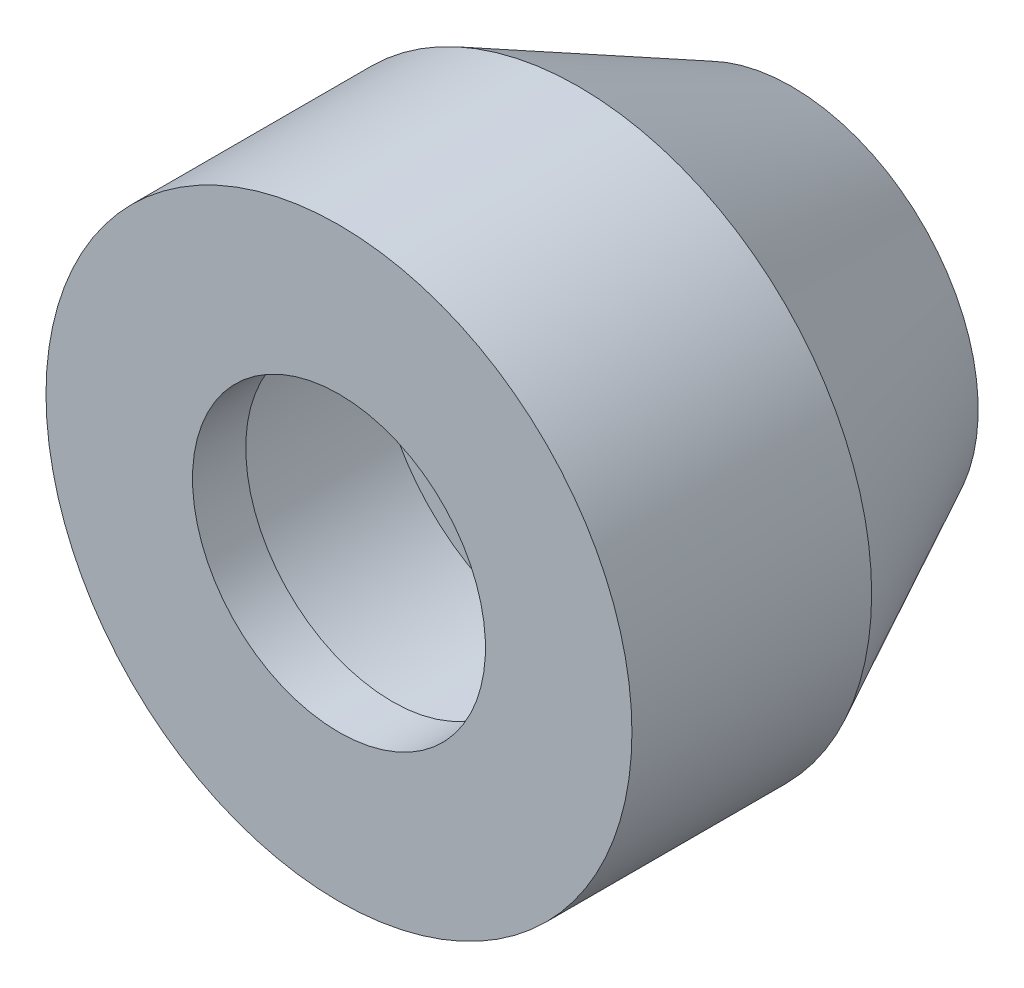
ISO-10303-21;
HEADER;
FILE_DESCRIPTION(('STEP AP214'),'2;1');
FILE_NAME('part.step','',(''),(''),'','','');
FILE_SCHEMA(('AUTOMOTIVE_DESIGN { 1 0 10303 214 1 1 1 1 }'));
ENDSEC;
DATA;
#1=APPLICATION_CONTEXT('core data for automotive mechanical design processes');
#2=APPLICATION_PROTOCOL_DEFINITION('international standard','automotive_design',2000,#1);
#3=PRODUCT_CONTEXT('',#1,'mechanical');
#4=PRODUCT('Part','Part','',(#3));
#5=PRODUCT_RELATED_PRODUCT_CATEGORY('part','',(#4));
#6=PRODUCT_DEFINITION_FORMATION('','',#4);
#7=PRODUCT_DEFINITION_CONTEXT('part definition',#1,'design');
#8=PRODUCT_DEFINITION('design','',#6,#7);
#9=PRODUCT_DEFINITION_SHAPE('','',#8);
#10=(LENGTH_UNIT() NAMED_UNIT(*) SI_UNIT(.MILLI.,.METRE.));
#11=(NAMED_UNIT(*) PLANE_ANGLE_UNIT() SI_UNIT($,.RADIAN.));
#12=(NAMED_UNIT(*) SI_UNIT($,.STERADIAN.) SOLID_ANGLE_UNIT());
#13=UNCERTAINTY_MEASURE_WITH_UNIT(LENGTH_MEASURE(1.E-05),#10,'distance_accuracy_value','');
#14=(GEOMETRIC_REPRESENTATION_CONTEXT(3) GLOBAL_UNCERTAINTY_ASSIGNED_CONTEXT((#13)) GLOBAL_UNIT_ASSIGNED_CONTEXT((#10,
#11,#12)) REPRESENTATION_CONTEXT('',''));
#15=CARTESIAN_POINT('',(0.,0.,0.));
#16=DIRECTION('',(0.,0.,1.));
#17=DIRECTION('',(1.,0.,0.));
#18=AXIS2_PLACEMENT_3D('',#15,#16,#17);
#19=CARTESIAN_POINT('',(0.,0.,4.3));
#20=DIRECTION('',(0.,0.,1.));
#21=DIRECTION('',(0.,-1.,0.));
#22=AXIS2_PLACEMENT_3D('',#19,#20,#21);
#23=PLANE('',#22);
#24=CARTESIAN_POINT('',(0.,0.,4.3));
#25=DIRECTION('',(0.,0.,1.));
#26=DIRECTION('',(0.,-1.,0.));
#27=AXIS2_PLACEMENT_3D('',#24,#25,#26);
#28=CIRCLE('',#27,3.5);
#29=CARTESIAN_POINT('',(0.,-3.5,4.3));
#30=VERTEX_POINT('',#29);
#31=EDGE_CURVE('E8',#30,#30,#28,.T.);
#32=ORIENTED_EDGE('',*,*,#31,.T.);
#33=EDGE_LOOP('',(#32));
#34=FACE_BOUND('',#33,.T.);
#35=ADVANCED_FACE('F12',(#34),#23,.T.);
#36=CARTESIAN_POINT('',(0.,0.,0.));
#37=DIRECTION('',(0.,0.,1.));
#38=DIRECTION('',(0.,-1.,0.));
#39=AXIS2_PLACEMENT_3D('',#36,#37,#38);
#40=CYLINDRICAL_SURFACE('',#39,3.5);
#41=CARTESIAN_POINT('',(0.,0.,7.5));
#42=DIRECTION('',(0.,0.,1.));
#43=DIRECTION('',(0.,-1.,0.));
#44=AXIS2_PLACEMENT_3D('',#41,#42,#43);
#45=CIRCLE('',#44,3.5);
#46=CARTESIAN_POINT('',(0.,-3.5,7.5));
#47=VERTEX_POINT('',#46);
#48=EDGE_CURVE('E18',#47,#47,#45,.T.);
#49=ORIENTED_EDGE('',*,*,#48,.T.);
#50=EDGE_LOOP('',(#49));
#51=FACE_BOUND('',#50,.T.);
#52=ORIENTED_EDGE('',*,*,#31,.F.);
#53=EDGE_LOOP('',(#52));
#54=FACE_BOUND('',#53,.T.);
#55=ADVANCED_FACE('F55',(#51,#54),#40,.F.);
#56=CARTESIAN_POINT('',(3.5,0.,7.5));
#57=DIRECTION('',(0.,0.,-1.));
#58=DIRECTION('',(0.,1.,0.));
#59=AXIS2_PLACEMENT_3D('',#56,#57,#58);
#60=PLANE('',#59);
#61=CARTESIAN_POINT('',(0.,0.,7.5));
#62=DIRECTION('',(0.,0.,1.));
#63=DIRECTION('',(0.,-1.,0.));
#64=AXIS2_PLACEMENT_3D('',#61,#62,#63);
#65=CIRCLE('',#64,2.75);
#66=CARTESIAN_POINT('',(0.,-2.75,7.5));
#67=VERTEX_POINT('',#66);
#68=EDGE_CURVE('E22',#67,#67,#65,.T.);
#69=ORIENTED_EDGE('',*,*,#68,.T.);
#70=EDGE_LOOP('',(#69));
#71=FACE_BOUND('',#70,.T.);
#72=ORIENTED_EDGE('',*,*,#48,.F.);
#73=EDGE_LOOP('',(#72));
#74=FACE_BOUND('',#73,.T.);
#75=ADVANCED_FACE('F60',(#71,#74),#60,.T.);
#76=CARTESIAN_POINT('',(0.,0.,0.));
#77=DIRECTION('',(0.,0.,1.));
#78=DIRECTION('',(0.,-1.,0.));
#79=AXIS2_PLACEMENT_3D('',#76,#77,#78);
#80=CYLINDRICAL_SURFACE('',#79,2.75);
#81=CARTESIAN_POINT('',(0.,0.,8.5));
#82=DIRECTION('',(0.,0.,1.));
#83=DIRECTION('',(0.,-1.,0.));
#84=AXIS2_PLACEMENT_3D('',#81,#82,#83);
#85=CIRCLE('',#84,2.75);
#86=CARTESIAN_POINT('',(0.,-2.75,8.5));
#87=VERTEX_POINT('',#86);
#88=EDGE_CURVE('E26',#87,#87,#85,.T.);
#89=ORIENTED_EDGE('',*,*,#88,.T.);
#90=EDGE_LOOP('',(#89));
#91=FACE_BOUND('',#90,.T.);
#92=ORIENTED_EDGE('',*,*,#68,.F.);
#93=EDGE_LOOP('',(#92));
#94=FACE_BOUND('',#93,.T.);
#95=ADVANCED_FACE('F65',(#91,#94),#80,.F.);
#96=CARTESIAN_POINT('',(2.75,0.,8.5));
#97=DIRECTION('',(0.,0.,1.));
#98=DIRECTION('',(0.,-1.,0.));
#99=AXIS2_PLACEMENT_3D('',#96,#97,#98);
#100=PLANE('',#99);
#101=CARTESIAN_POINT('',(0.,0.,8.5));
#102=DIRECTION('',(0.,0.,1.));
#103=DIRECTION('',(0.,-1.,0.));
#104=AXIS2_PLACEMENT_3D('',#101,#102,#103);
#105=CIRCLE('',#104,5.5);
#106=CARTESIAN_POINT('',(0.,-5.5,8.5));
#107=VERTEX_POINT('',#106);
#108=EDGE_CURVE('E31',#107,#107,#105,.T.);
#109=ORIENTED_EDGE('',*,*,#108,.T.);
#110=EDGE_LOOP('',(#109));
#111=FACE_BOUND('',#110,.T.);
#112=ORIENTED_EDGE('',*,*,#88,.F.);
#113=EDGE_LOOP('',(#112));
#114=FACE_BOUND('',#113,.T.);
#115=ADVANCED_FACE('F72',(#111,#114),#100,.T.);
#116=CARTESIAN_POINT('',(0.,0.,0.));
#117=DIRECTION('',(0.,0.,1.));
#118=DIRECTION('',(0.,-1.,0.));
#119=AXIS2_PLACEMENT_3D('',#116,#117,#118);
#120=CYLINDRICAL_SURFACE('',#119,5.5);
#121=CARTESIAN_POINT('',(0.,0.,4.));
#122=DIRECTION('',(0.,0.,1.));
#123=DIRECTION('',(0.,-1.,0.));
#124=AXIS2_PLACEMENT_3D('',#121,#122,#123);
#125=CIRCLE('',#124,5.5);
#126=CARTESIAN_POINT('',(0.,-5.5,4.));
#127=VERTEX_POINT('',#126);
#128=EDGE_CURVE('E34',#127,#127,#125,.T.);
#129=ORIENTED_EDGE('',*,*,#128,.T.);
#130=EDGE_LOOP('',(#129));
#131=FACE_BOUND('',#130,.T.);
#132=ORIENTED_EDGE('',*,*,#108,.F.);
#133=EDGE_LOOP('',(#132));
#134=FACE_BOUND('',#133,.T.);
#135=ADVANCED_FACE('F52',(#131,#134),#120,.T.);
#136=CARTESIAN_POINT('',(0.,0.,4.));
#137=DIRECTION('',(0.,0.,1.));
#138=DIRECTION('',(0.,-1.,0.));
#139=AXIS2_PLACEMENT_3D('',#136,#137,#138);
#140=CONICAL_SURFACE('',#139,5.5,0.463647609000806);
#141=CARTESIAN_POINT('',(0.,0.,0.));
#142=DIRECTION('',(0.,0.,1.));
#143=DIRECTION('',(0.,-1.,0.));
#144=AXIS2_PLACEMENT_3D('',#141,#142,#143);
#145=CIRCLE('',#144,3.5);
#146=CARTESIAN_POINT('',(0.,-3.5,0.));
#147=VERTEX_POINT('',#146);
#148=EDGE_CURVE('E37',#147,#147,#145,.T.);
#149=ORIENTED_EDGE('',*,*,#148,.T.);
#150=EDGE_LOOP('',(#149));
#151=FACE_BOUND('',#150,.T.);
#152=ORIENTED_EDGE('',*,*,#128,.F.);
#153=EDGE_LOOP('',(#152));
#154=FACE_BOUND('',#153,.T.);
#155=ADVANCED_FACE('F41',(#151,#154),#140,.T.);
#156=CARTESIAN_POINT('',(3.5,0.,0.));
#157=DIRECTION('',(0.,0.,-1.));
#158=DIRECTION('',(0.,1.,0.));
#159=AXIS2_PLACEMENT_3D('',#156,#157,#158);
#160=PLANE('',#159);
#161=ORIENTED_EDGE('',*,*,#148,.F.);
#162=EDGE_LOOP('',(#161));
#163=FACE_BOUND('',#162,.T.);
#164=ADVANCED_FACE('F44',(#163),#160,.T.);
#165=CLOSED_SHELL('',(#35,#55,#75,#95,#115,#135,#155,#164));
#166=MANIFOLD_SOLID_BREP('B1',#165);
#167=ADVANCED_BREP_SHAPE_REPRESENTATION('',(#18,#166),#14);
#168=SHAPE_DEFINITION_REPRESENTATION(#9,#167);
ENDSEC;
END-ISO-10303-21;
